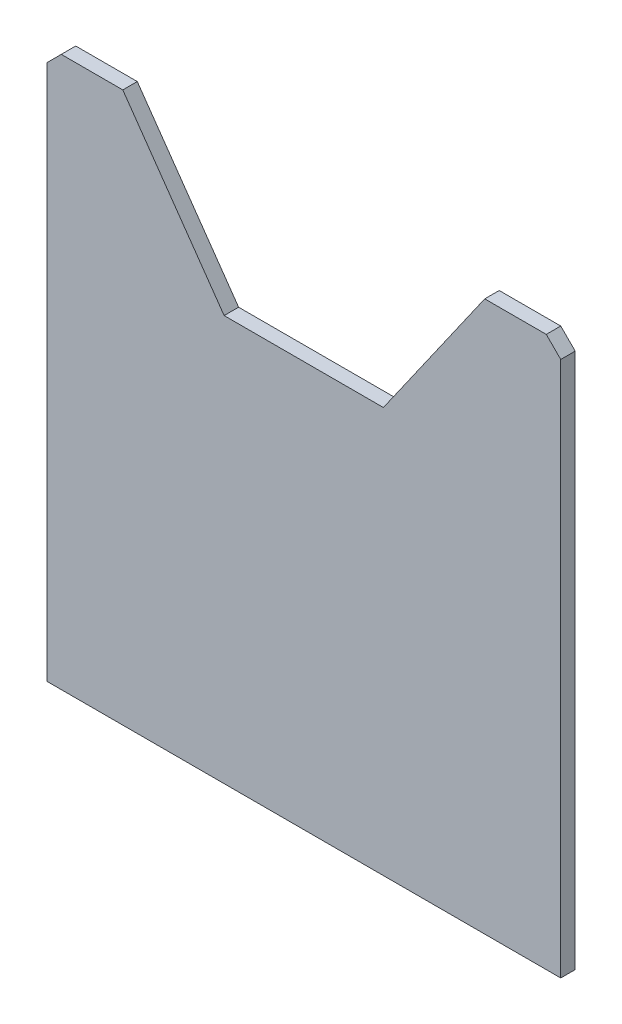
from build123d import *

# Parameters (mm, degrees)
BOSS_EXTRU_1_DEPTH = 10


with BuildPart() as part:
    # Esquisse1 → Boss.-Extru.1 (new body)
    with BuildSketch(Plane.XY):
        Polygon((122.5, 280), (232.5, 280), (302.5, 380), (345, 380), (355, 370), (355, 0), (0, 0), (0, 370), (10, 380), (52.5, 380), align=None)
    extrude(amount=BOSS_EXTRU_1_DEPTH)


solid = part.part
